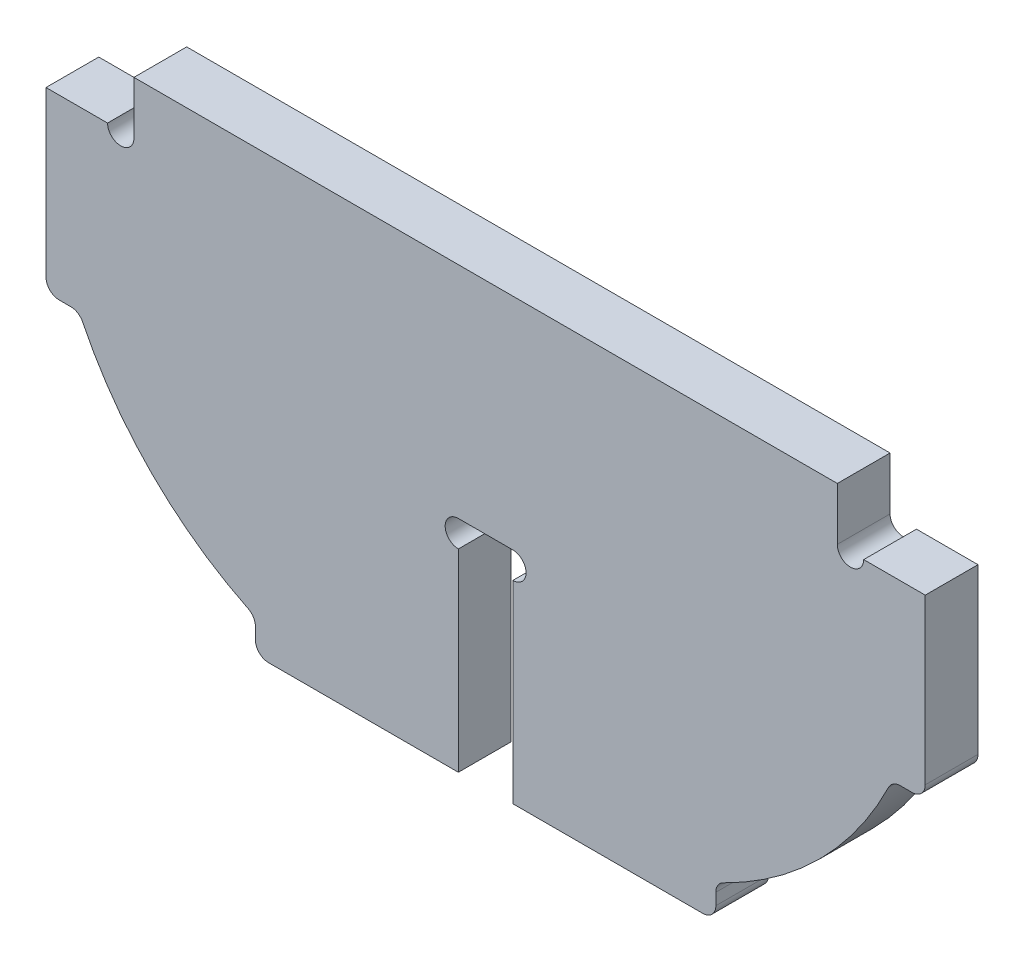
from build123d import *

# Parameters (mm, degrees)
CROSSBRACE_EXTRUDE_DEPTH = 12
CUT_EXTRUDE2_DEPTH       = 113.445542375
CUT_EXTRUDE3_DEPTH       = 113.445542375


with BuildPart() as part:
    # Crossbrace_Profile → Crossbrace_Extrude (new body)
    with BuildSketch(Plane.XY):
        with BuildLine():
            Line((-80, 50), (80, 50))
            Line((80, 50), (80, 38))
            ThreePointArc((80, 38), (83, 35), (86, 38))
            Line((86, 38), (100, 38))
            Line((100, 38), (100, -50))
            Line((100, -50), (-100, -50))
            Line((-100, -50), (-100, 38))
            Line((-100, 38), (-86, 38))
            ThreePointArc((-86, 38), (-83, 35), (-80, 38))
            Line((-80, 38), (-80, 50))
        make_face()
    extrude(amount=CROSSBRACE_EXTRUDE_DEPTH)

    # Slot → Cut-Extrude2 (cut, through all)
    with BuildSketch(Plane.XY):
        with BuildLine():
            Line((6.2, -50), (-6.2, -50))
            Line((-6.2, -50), (-6.2, -6))
            ThreePointArc((-6.2, -6), (-9.2, -3), (-6.2, 0))
            Line((-6.2, 0), (6.2, 0))
            ThreePointArc((6.2, 0), (9.2, -3), (6.2, -6))
            Line((6.2, -6), (6.2, -50))
        make_face()
    extrude(amount=CUT_EXTRUDE2_DEPTH, mode=Mode.SUBTRACT)

    # Sketch4 → Cut-Extrude3 (cut, through all)
    with BuildSketch(Plane.XY):
        with BuildLine():
            Line((100, -50), (49.368774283, -50))
            ThreePointArc((49.368774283, -50), (51.490094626, -49.121320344), (52.368774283, -47))
            Line((52.368774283, -47), (52.368774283, -44.345102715))
            ThreePointArc((52.368774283, -44.345102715), (52.823514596, -42.757131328), (54.049876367, -41.650569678))
            ThreePointArc((54.049876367, -41.650569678), (75.982756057, -25.982756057), (91.650569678, -4.049876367))
            ThreePointArc((91.650569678, -4.049876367), (92.757131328, -2.823514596), (94.345102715, -2.368774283))
            Line((94.345102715, -2.368774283), (97, -2.368774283))
            ThreePointArc((97, -2.368774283), (99.121320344, -1.490094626), (100, 0.631225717))
            Line((100, 0.631225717), (100, -50))
        make_face()
    cut_extrude3 = extrude(amount=CUT_EXTRUDE3_DEPTH, mode=Mode.SUBTRACT)

    # Mirror1: Cut-Extrude3 across plane
    add(cut_extrude3.mirror(Plane(origin=(0, 0, 0), x_dir=(0, 0, 1), z_dir=(1, 0, 0))), mode=Mode.SUBTRACT)


solid = part.part
